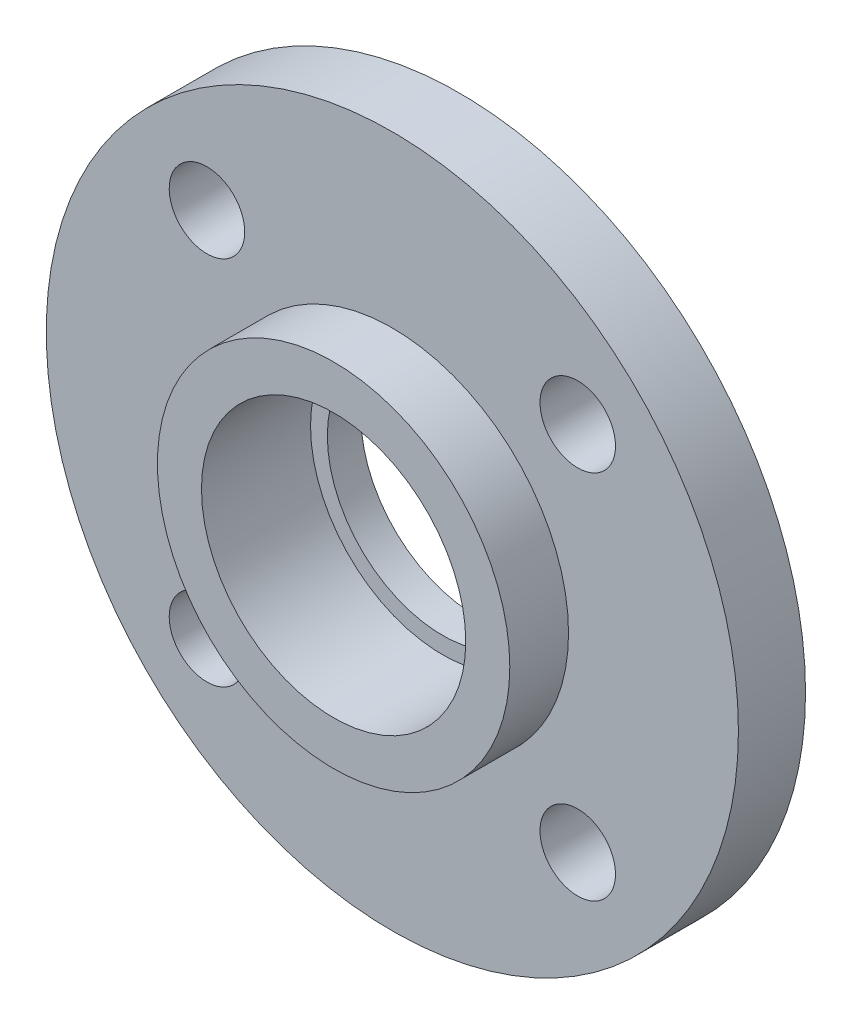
from build123d import *

# Parameters (mm, degrees)
FLANGE_BODY_SKETCH_R     = 82.5
FLANGE_BODY_DEPTH        = 20
NECK_SKETCH_R            = 42
NECK_DEPTH               = 34
HUB_CUT_SKETCH_OUTSIDE_W = 214.162
HUB_CUT_SKETCH_OUTSIDE_H = 214.162
HUB_CUT_SKETCH_OUTSIDE_R = 49.5
HUB_CUT_DEPTH            = 4
BORE_SKETCH_R            = 27.5
BORE_DEPTH               = 8
DE_CUT_SKETCH_R          = 31.5
DE_CUT_DEPTH             = 120.534513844
BOLT_HOLE_SKETCH_R       = 9
BOLT_HOLE_DEPTH          = 119.374406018
BOLT_HOLE_PATTERN_COUNT  = 4


with BuildPart() as part:
    # Flange Body Sketch → Flange Body (new body)
    with BuildSketch(Plane.XY):
        Circle(FLANGE_BODY_SKETCH_R)
    extrude(amount=-FLANGE_BODY_DEPTH)

    # Neck Sketch → Neck (add)
    with BuildSketch(Plane.XY.offset(-20)):
        Circle(NECK_SKETCH_R)
    extrude(amount=NECK_DEPTH)

    # Hub Cut Sketch outside → Hub Cut (cut)
    with BuildSketch(Plane(origin=(0, 0, -20), x_dir=(-1, 0, 0), z_dir=(0, 0, -1))):
        Rectangle(HUB_CUT_SKETCH_OUTSIDE_W, HUB_CUT_SKETCH_OUTSIDE_H)
        Circle(HUB_CUT_SKETCH_OUTSIDE_R, mode=Mode.SUBTRACT)
    extrude(amount=-HUB_CUT_DEPTH, mode=Mode.SUBTRACT)

    # Bore Sketch → Bore (cut)
    with BuildSketch(Plane(origin=(0, 0, -20), x_dir=(-1, 0, 0), z_dir=(0, 0, -1))):
        Circle(BORE_SKETCH_R)
    extrude(amount=-BORE_DEPTH, mode=Mode.SUBTRACT)

    # De Cut Sketch → De Cut (cut, through all)
    with BuildSketch(Plane(origin=(0, 0, -12), x_dir=(-1, 0, 0), z_dir=(0, 0, -1))):
        Circle(DE_CUT_SKETCH_R)
    extrude(amount=-DE_CUT_DEPTH, mode=Mode.SUBTRACT)

    # Bolt Hole Sketch → Bolt Hole (cut, through all)
    with BuildSketch(Plane.XY):
        with Locations((44.194173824, 44.194173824)):
            Circle(BOLT_HOLE_SKETCH_R)
    bolt_hole = extrude(amount=-BOLT_HOLE_DEPTH, mode=Mode.SUBTRACT)

    # Bolt Hole Pattern: Bolt Hole ×4 about axis
    bolt_hole_pattern_axis = Axis((0, 0, 0), (0, 0, 1))
    for i in range(1, BOLT_HOLE_PATTERN_COUNT):
        add(bolt_hole.rotate(bolt_hole_pattern_axis, i * 360 / BOLT_HOLE_PATTERN_COUNT), mode=Mode.SUBTRACT)


solid = part.part
